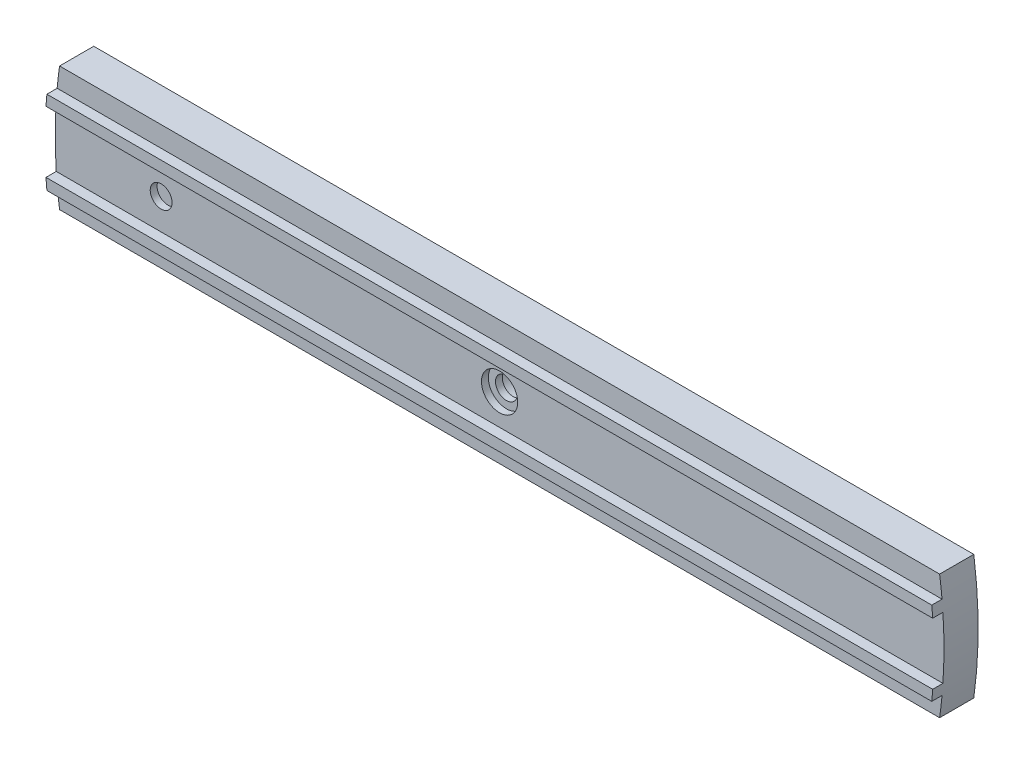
from build123d import *

# Parameters (mm, degrees)
ESQUISSE1_R             = 1.6
BOSS_EXTRU_1_DEPTH      = 5
BOSS_EXTRU_2_START      = 1.5
BOSS_EXTRU_2_DEPTH      = 1.5
ENL_V_START             = -5
ESQUISSE2_R             = 2.65
ESQUISSE2_R_2           = 1.6
ENL_V_MAT_EXTRU_3_DEPTH = 3
ENL_V_START_2           = -1
ESQUISSE2_3_R           = 2.65
ESQUISSE2_3_R_2         = 1.6
ENL_V_MAT_EXTRU_4_DEPTH = 1


with BuildPart() as part:
    # Esquisse1 → Boss.-Extru.1 (new body)
    with BuildSketch(Plane.XY):
        with BuildLine():
            Line((-64.359847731, -9.1), (64.359847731, -9.1))
            ThreePointArc((64.359847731, -9.1), (65, 0), (64.359847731, 9.1))
            Line((64.359847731, 9.1), (-64.359847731, 9.1))
            ThreePointArc((-64.359847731, 9.1), (-65, 0), (-64.359847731, -9.1))
        make_face()
        Circle(ESQUISSE1_R, mode=Mode.SUBTRACT)
    extrude(amount=-BOSS_EXTRU_1_DEPTH)

    # Esquisse1_3 → Boss.-Extru.2 (add)
    with BuildSketch(Plane.XY.offset(BOSS_EXTRU_2_START)):
        with BuildLine():
            Line((64.713136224, 6.1), (-64.713136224, 6.1))
            ThreePointArc((-64.713136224, 6.1), (-64.783529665, 5.300404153), (-64.844043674, 4.5))
            Line((-64.844043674, 4.5), (64.844043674, 4.5))
            ThreePointArc((64.844043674, 4.5), (64.783529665, 5.300404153), (64.713136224, 6.1))
        make_face()
        with BuildLine():
            Line((64.844043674, -4.5), (-64.844043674, -4.5))
            ThreePointArc((-64.844043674, -4.5), (-64.783529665, -5.300404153), (-64.713136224, -6.1))
            Line((-64.713136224, -6.1), (64.713136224, -6.1))
            ThreePointArc((64.713136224, -6.1), (64.783529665, -5.300404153), (64.844043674, -4.5))
        make_face()
    extrude(amount=-BOSS_EXTRU_2_DEPTH)

    # Esquisse2 → Enl_v. mat.-Extru.3 (cut)
    with BuildSketch(Plane.XY.offset(ENL_V_START)):
        Circle(ESQUISSE2_R)
        with Locations((-49.5, 0)):
            Circle(ESQUISSE2_R_2)
    extrude(amount=ENL_V_MAT_EXTRU_3_DEPTH, mode=Mode.SUBTRACT)

    # Esquisse2_3 → Enl_v. mat.-Extru.4 (cut)
    with BuildSketch(Plane.XY.offset(ENL_V_START_2)):
        Circle(ESQUISSE2_3_R)
        with Locations((-49.5, 0)):
            Circle(ESQUISSE2_3_R_2)
    extrude(amount=ENL_V_MAT_EXTRU_4_DEPTH, mode=Mode.SUBTRACT)


solid = part.part
